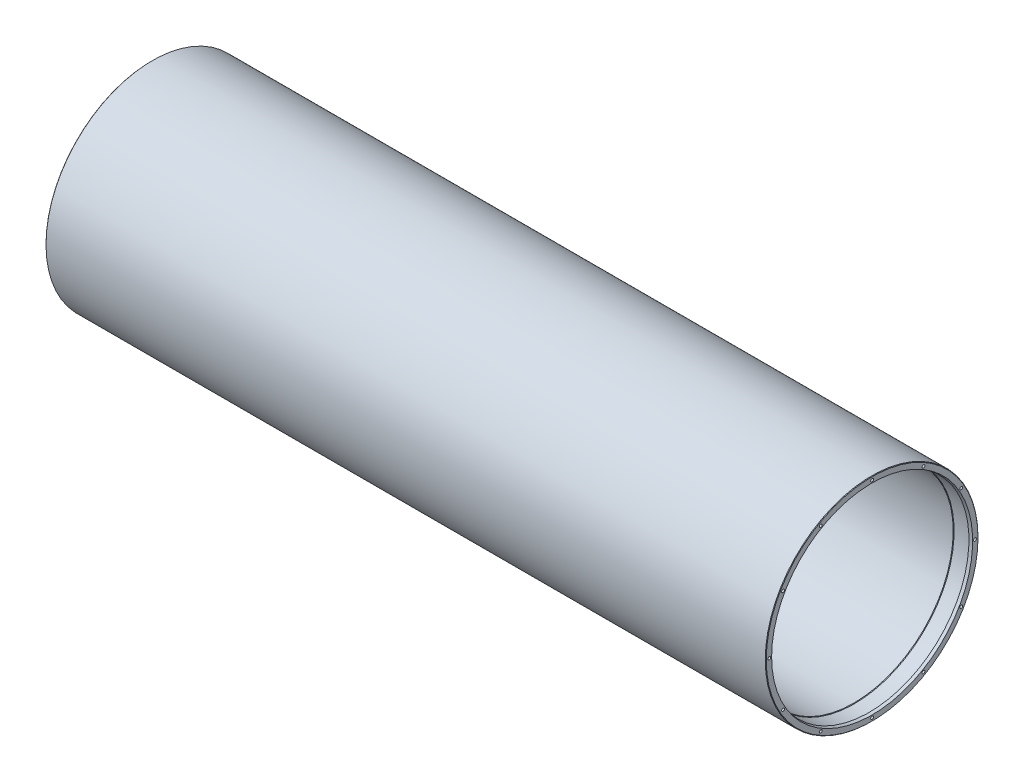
ISO-10303-21;
HEADER;
FILE_DESCRIPTION(('STEP AP214'),'2;1');
FILE_NAME('part.step','',(''),(''),'','','');
FILE_SCHEMA(('AUTOMOTIVE_DESIGN { 1 0 10303 214 1 1 1 1 }'));
ENDSEC;
DATA;
#1=APPLICATION_CONTEXT('core data for automotive mechanical design processes');
#2=APPLICATION_PROTOCOL_DEFINITION('international standard','automotive_design',2000,#1);
#3=PRODUCT_CONTEXT('',#1,'mechanical');
#4=PRODUCT('Part','Part','',(#3));
#5=PRODUCT_RELATED_PRODUCT_CATEGORY('part','',(#4));
#6=PRODUCT_DEFINITION_FORMATION('','',#4);
#7=PRODUCT_DEFINITION_CONTEXT('part definition',#1,'design');
#8=PRODUCT_DEFINITION('design','',#6,#7);
#9=PRODUCT_DEFINITION_SHAPE('','',#8);
#10=(LENGTH_UNIT() NAMED_UNIT(*) SI_UNIT(.MILLI.,.METRE.));
#11=(NAMED_UNIT(*) PLANE_ANGLE_UNIT() SI_UNIT($,.RADIAN.));
#12=(NAMED_UNIT(*) SI_UNIT($,.STERADIAN.) SOLID_ANGLE_UNIT());
#13=UNCERTAINTY_MEASURE_WITH_UNIT(LENGTH_MEASURE(1.E-05),#10,'distance_accuracy_value','');
#14=(GEOMETRIC_REPRESENTATION_CONTEXT(3) GLOBAL_UNCERTAINTY_ASSIGNED_CONTEXT((#13)) GLOBAL_UNIT_ASSIGNED_CONTEXT((#10,
#11,#12)) REPRESENTATION_CONTEXT('',''));
#15=CARTESIAN_POINT('',(0.,0.,0.));
#16=DIRECTION('',(0.,0.,1.));
#17=DIRECTION('',(1.,0.,0.));
#18=AXIS2_PLACEMENT_3D('',#15,#16,#17);
#19=CARTESIAN_POINT('',(6.63558633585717,0.,0.));
#20=DIRECTION('',(-1.,0.,0.));
#21=DIRECTION('',(0.,0.,1.));
#22=AXIS2_PLACEMENT_3D('',#19,#20,#21);
#23=CONICAL_SURFACE('',#22,228.6,0.261799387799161);
#24=CARTESIAN_POINT('',(0.,0.,0.));
#25=DIRECTION('',(-1.,0.,0.));
#26=DIRECTION('',(0.,0.,1.));
#27=AXIS2_PLACEMENT_3D('',#24,#25,#26);
#28=CIRCLE('',#27,230.378);
#29=CARTESIAN_POINT('',(0.,0.,230.378));
#30=VERTEX_POINT('',#29);
#31=EDGE_CURVE('E614',#30,#30,#28,.T.);
#32=ORIENTED_EDGE('',*,*,#31,.T.);
#33=EDGE_LOOP('',(#32));
#34=FACE_BOUND('',#33,.T.);
#35=CARTESIAN_POINT('',(6.63558633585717,0.,0.));
#36=DIRECTION('',(-1.,0.,0.));
#37=DIRECTION('',(0.,0.,1.));
#38=AXIS2_PLACEMENT_3D('',#35,#36,#37);
#39=CIRCLE('',#38,228.6);
#40=CARTESIAN_POINT('',(6.63558633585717,0.,228.6));
#41=VERTEX_POINT('',#40);
#42=EDGE_CURVE('E653',#41,#41,#39,.T.);
#43=ORIENTED_EDGE('',*,*,#42,.F.);
#44=EDGE_LOOP('',(#43));
#45=FACE_BOUND('',#44,.T.);
#46=ADVANCED_FACE('F381',(#34,#45),#23,.F.);
#47=CARTESIAN_POINT('',(0.,0.,0.));
#48=DIRECTION('',(-1.,0.,0.));
#49=DIRECTION('',(0.,0.,1.));
#50=AXIS2_PLACEMENT_3D('',#47,#48,#49);
#51=CYLINDRICAL_SURFACE('',#50,228.6);
#52=ORIENTED_EDGE('',*,*,#42,.T.);
#53=EDGE_LOOP('',(#52));
#54=FACE_BOUND('',#53,.T.);
#55=CARTESIAN_POINT('',(40.64,0.,0.));
#56=DIRECTION('',(-1.,0.,0.));
#57=DIRECTION('',(0.,0.,1.));
#58=AXIS2_PLACEMENT_3D('',#55,#56,#57);
#59=CIRCLE('',#58,228.6);
#60=CARTESIAN_POINT('',(40.64,0.,228.6));
#61=VERTEX_POINT('',#60);
#62=EDGE_CURVE('E650',#61,#61,#59,.T.);
#63=ORIENTED_EDGE('',*,*,#62,.F.);
#64=EDGE_LOOP('',(#63));
#65=FACE_BOUND('',#64,.T.);
#66=ADVANCED_FACE('F760',(#54,#65),#51,.F.);
#67=CARTESIAN_POINT('',(41.9598227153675,0.,0.));
#68=DIRECTION('',(-1.,0.,0.));
#69=DIRECTION('',(0.,0.,1.));
#70=AXIS2_PLACEMENT_3D('',#67,#68,#69);
#71=CONICAL_SURFACE('',#70,227.838,0.523598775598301);
#72=ORIENTED_EDGE('',*,*,#62,.T.);
#73=EDGE_LOOP('',(#72));
#74=FACE_BOUND('',#73,.T.);
#75=CARTESIAN_POINT('',(41.9598227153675,0.,0.));
#76=DIRECTION('',(-1.,0.,0.));
#77=DIRECTION('',(0.,0.,1.));
#78=AXIS2_PLACEMENT_3D('',#75,#76,#77);
#79=CIRCLE('',#78,227.838);
#80=CARTESIAN_POINT('',(41.9598227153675,0.,227.838));
#81=VERTEX_POINT('',#80);
#82=EDGE_CURVE('E647',#81,#81,#79,.T.);
#83=ORIENTED_EDGE('',*,*,#82,.F.);
#84=EDGE_LOOP('',(#83));
#85=FACE_BOUND('',#84,.T.);
#86=ADVANCED_FACE('F765',(#74,#85),#71,.F.);
#87=CARTESIAN_POINT('',(0.,0.,0.));
#88=DIRECTION('',(-1.,0.,0.));
#89=DIRECTION('',(0.,0.,1.));
#90=AXIS2_PLACEMENT_3D('',#87,#88,#89);
#91=CYLINDRICAL_SURFACE('',#90,227.838);
#92=ORIENTED_EDGE('',*,*,#82,.T.);
#93=EDGE_LOOP('',(#92));
#94=FACE_BOUND('',#93,.T.);
#95=CARTESIAN_POINT('',(704.2658,0.,0.));
#96=DIRECTION('',(-1.,0.,0.));
#97=DIRECTION('',(0.,0.,1.));
#98=AXIS2_PLACEMENT_3D('',#95,#96,#97);
#99=CIRCLE('',#98,227.838);
#100=CARTESIAN_POINT('',(704.2658,0.,227.838));
#101=VERTEX_POINT('',#100);
#102=EDGE_CURVE('E644',#101,#101,#99,.T.);
#103=ORIENTED_EDGE('',*,*,#102,.F.);
#104=EDGE_LOOP('',(#103));
#105=FACE_BOUND('',#104,.T.);
#106=ADVANCED_FACE('F775',(#94,#105),#91,.F.);
#107=CARTESIAN_POINT('',(704.2658,0.,0.));
#108=DIRECTION('',(-1.,0.,0.));
#109=DIRECTION('',(0.,0.,1.));
#110=AXIS2_PLACEMENT_3D('',#107,#108,#109);
#111=TOROIDAL_SURFACE('',#110,226.2378,1.60020000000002);
#112=ORIENTED_EDGE('',*,*,#102,.T.);
#113=EDGE_LOOP('',(#112));
#114=FACE_BOUND('',#113,.T.);
#115=CARTESIAN_POINT('',(705.866,0.,0.));
#116=DIRECTION('',(-1.,0.,0.));
#117=DIRECTION('',(0.,0.,1.));
#118=AXIS2_PLACEMENT_3D('',#115,#116,#117);
#119=CIRCLE('',#118,226.2378);
#120=CARTESIAN_POINT('',(705.866,0.,226.2378));
#121=VERTEX_POINT('',#120);
#122=EDGE_CURVE('E641',#121,#121,#119,.T.);
#123=ORIENTED_EDGE('',*,*,#122,.F.);
#124=EDGE_LOOP('',(#123));
#125=FACE_BOUND('',#124,.T.);
#126=ADVANCED_FACE('F781',(#114,#125),#111,.F.);
#127=CARTESIAN_POINT('',(705.866,-222.25,0.));
#128=DIRECTION('',(-1.,0.,0.));
#129=DIRECTION('',(0.,0.,1.));
#130=AXIS2_PLACEMENT_3D('',#127,#128,#129);
#131=PLANE('',#130);
#132=CARTESIAN_POINT('',(705.866,0.,0.));
#133=DIRECTION('',(-1.,0.,0.));
#134=DIRECTION('',(0.,0.,1.));
#135=AXIS2_PLACEMENT_3D('',#132,#133,#134);
#136=CIRCLE('',#135,222.758);
#137=CARTESIAN_POINT('',(705.866,0.,222.758));
#138=VERTEX_POINT('',#137);
#139=EDGE_CURVE('E388',#138,#138,#136,.F.);
#140=ORIENTED_EDGE('',*,*,#139,.T.);
#141=EDGE_LOOP('',(#140));
#142=FACE_BOUND('',#141,.T.);
#143=ORIENTED_EDGE('',*,*,#122,.T.);
#144=EDGE_LOOP('',(#143));
#145=FACE_BOUND('',#144,.T.);
#146=ADVANCED_FACE('F676',(#142,#145),#131,.T.);
#147=CARTESIAN_POINT('',(0.,0.,0.));
#148=DIRECTION('',(-1.,0.,0.));
#149=DIRECTION('',(0.,0.,1.));
#150=AXIS2_PLACEMENT_3D('',#147,#148,#149);
#151=CYLINDRICAL_SURFACE('',#150,222.25);
#152=CARTESIAN_POINT('',(706.307597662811,0.,0.));
#153=DIRECTION('',(-1.,0.,0.));
#154=DIRECTION('',(0.,0.,1.));
#155=AXIS2_PLACEMENT_3D('',#152,#153,#154);
#156=CIRCLE('',#155,222.25);
#157=CARTESIAN_POINT('',(706.307597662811,0.,222.25));
#158=VERTEX_POINT('',#157);
#159=EDGE_CURVE('E671',#158,#158,#156,.T.);
#160=ORIENTED_EDGE('',*,*,#159,.T.);
#161=EDGE_LOOP('',(#160));
#162=FACE_BOUND('',#161,.T.);
#163=CARTESIAN_POINT('',(712.978,0.,0.));
#164=DIRECTION('',(1.,0.,0.));
#165=DIRECTION('',(0.,0.,-1.));
#166=AXIS2_PLACEMENT_3D('',#163,#164,#165);
#167=CIRCLE('',#166,222.25);
#168=CARTESIAN_POINT('',(712.978,0.,-222.25));
#169=VERTEX_POINT('',#168);
#170=EDGE_CURVE('E668',#169,#169,#167,.T.);
#171=ORIENTED_EDGE('',*,*,#170,.T.);
#172=EDGE_LOOP('',(#171));
#173=FACE_BOUND('',#172,.T.);
#174=ADVANCED_FACE('F687',(#162,#173),#151,.F.);
#175=CARTESIAN_POINT('',(713.486,-222.25,0.));
#176=DIRECTION('',(1.,0.,0.));
#177=DIRECTION('',(0.,0.,-1.));
#178=AXIS2_PLACEMENT_3D('',#175,#176,#177);
#179=PLANE('',#178);
#180=CARTESIAN_POINT('',(713.486,0.,0.));
#181=DIRECTION('',(1.,0.,0.));
#182=DIRECTION('',(0.,0.,-1.));
#183=AXIS2_PLACEMENT_3D('',#180,#181,#182);
#184=CIRCLE('',#183,222.691597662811);
#185=CARTESIAN_POINT('',(713.486,0.,-222.691597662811));
#186=VERTEX_POINT('',#185);
#187=EDGE_CURVE('E11',#186,#186,#184,.F.);
#188=ORIENTED_EDGE('',*,*,#187,.T.);
#189=EDGE_LOOP('',(#188));
#190=FACE_BOUND('',#189,.T.);
#191=CARTESIAN_POINT('',(713.486,0.,0.));
#192=DIRECTION('',(-1.,0.,0.));
#193=DIRECTION('',(0.,0.,1.));
#194=AXIS2_PLACEMENT_3D('',#191,#192,#193);
#195=CIRCLE('',#194,224.5868);
#196=CARTESIAN_POINT('',(713.486,0.,224.5868));
#197=VERTEX_POINT('',#196);
#198=EDGE_CURVE('E638',#197,#197,#195,.T.);
#199=ORIENTED_EDGE('',*,*,#198,.F.);
#200=EDGE_LOOP('',(#199));
#201=FACE_BOUND('',#200,.T.);
#202=ADVANCED_FACE('F690',(#190,#201),#179,.T.);
#203=CARTESIAN_POINT('',(714.3242,0.,0.));
#204=DIRECTION('',(-1.,0.,0.));
#205=DIRECTION('',(0.,0.,1.));
#206=AXIS2_PLACEMENT_3D('',#203,#204,#205);
#207=TOROIDAL_SURFACE('',#206,224.5868,0.838200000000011);
#208=ORIENTED_EDGE('',*,*,#198,.T.);
#209=EDGE_LOOP('',(#208));
#210=FACE_BOUND('',#209,.T.);
#211=CARTESIAN_POINT('',(714.3242,0.,0.));
#212=DIRECTION('',(-1.,0.,0.));
#213=DIRECTION('',(0.,0.,1.));
#214=AXIS2_PLACEMENT_3D('',#211,#212,#213);
#215=CIRCLE('',#214,225.425);
#216=CARTESIAN_POINT('',(714.3242,0.,225.425));
#217=VERTEX_POINT('',#216);
#218=EDGE_CURVE('E635',#217,#217,#215,.T.);
#219=ORIENTED_EDGE('',*,*,#218,.F.);
#220=EDGE_LOOP('',(#219));
#221=FACE_BOUND('',#220,.T.);
#222=ADVANCED_FACE('F701',(#210,#221),#207,.F.);
#223=CARTESIAN_POINT('',(0.,0.,0.));
#224=DIRECTION('',(-1.,0.,0.));
#225=DIRECTION('',(0.,0.,1.));
#226=AXIS2_PLACEMENT_3D('',#223,#224,#225);
#227=CYLINDRICAL_SURFACE('',#226,225.425);
#228=ORIENTED_EDGE('',*,*,#218,.T.);
#229=EDGE_LOOP('',(#228));
#230=FACE_BOUND('',#229,.T.);
#231=CARTESIAN_POINT('',(762.646561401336,0.,0.));
#232=DIRECTION('',(-1.,0.,0.));
#233=DIRECTION('',(0.,0.,1.));
#234=AXIS2_PLACEMENT_3D('',#231,#232,#233);
#235=CIRCLE('',#234,225.425);
#236=CARTESIAN_POINT('',(762.646561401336,0.,225.425));
#237=VERTEX_POINT('',#236);
#238=EDGE_CURVE('E632',#237,#237,#235,.T.);
#239=ORIENTED_EDGE('',*,*,#238,.F.);
#240=EDGE_LOOP('',(#239));
#241=FACE_BOUND('',#240,.T.);
#242=ADVANCED_FACE('F707',(#230,#241),#227,.F.);
#243=CARTESIAN_POINT('',(771.652,0.,0.));
#244=DIRECTION('',(1.,0.,0.));
#245=DIRECTION('',(0.,0.,-1.));
#246=AXIS2_PLACEMENT_3D('',#243,#244,#245);
#247=CONICAL_SURFACE('',#246,227.838,0.261799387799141);
#248=ORIENTED_EDGE('',*,*,#238,.T.);
#249=EDGE_LOOP('',(#248));
#250=FACE_BOUND('',#249,.T.);
#251=CARTESIAN_POINT('',(771.652,0.,0.));
#252=DIRECTION('',(-1.,0.,0.));
#253=DIRECTION('',(0.,0.,1.));
#254=AXIS2_PLACEMENT_3D('',#251,#252,#253);
#255=CIRCLE('',#254,227.838);
#256=CARTESIAN_POINT('',(771.652,0.,227.838));
#257=VERTEX_POINT('',#256);
#258=EDGE_CURVE('E629',#257,#257,#255,.T.);
#259=ORIENTED_EDGE('',*,*,#258,.F.);
#260=EDGE_LOOP('',(#259));
#261=FACE_BOUND('',#260,.T.);
#262=ADVANCED_FACE('F713',(#250,#261),#247,.F.);
#263=CARTESIAN_POINT('',(0.,0.,0.));
#264=DIRECTION('',(-1.,0.,0.));
#265=DIRECTION('',(0.,0.,1.));
#266=AXIS2_PLACEMENT_3D('',#263,#264,#265);
#267=CYLINDRICAL_SURFACE('',#266,227.838);
#268=ORIENTED_EDGE('',*,*,#258,.T.);
#269=EDGE_LOOP('',(#268));
#270=FACE_BOUND('',#269,.T.);
#271=CARTESIAN_POINT('',(1609.04017728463,0.,0.));
#272=DIRECTION('',(-1.,0.,0.));
#273=DIRECTION('',(0.,0.,1.));
#274=AXIS2_PLACEMENT_3D('',#271,#272,#273);
#275=CIRCLE('',#274,227.838);
#276=CARTESIAN_POINT('',(1609.04017728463,0.,227.838));
#277=VERTEX_POINT('',#276);
#278=EDGE_CURVE('E626',#277,#277,#275,.T.);
#279=ORIENTED_EDGE('',*,*,#278,.F.);
#280=EDGE_LOOP('',(#279));
#281=FACE_BOUND('',#280,.T.);
#282=ADVANCED_FACE('F719',(#270,#281),#267,.F.);
#283=CARTESIAN_POINT('',(1610.36,0.,0.));
#284=DIRECTION('',(1.,0.,0.));
#285=DIRECTION('',(0.,0.,-1.));
#286=AXIS2_PLACEMENT_3D('',#283,#284,#285);
#287=CONICAL_SURFACE('',#286,228.6,0.523598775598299);
#288=ORIENTED_EDGE('',*,*,#278,.T.);
#289=EDGE_LOOP('',(#288));
#290=FACE_BOUND('',#289,.T.);
#291=CARTESIAN_POINT('',(1610.36,0.,0.));
#292=DIRECTION('',(-1.,0.,0.));
#293=DIRECTION('',(0.,0.,1.));
#294=AXIS2_PLACEMENT_3D('',#291,#292,#293);
#295=CIRCLE('',#294,228.6);
#296=CARTESIAN_POINT('',(1610.36,0.,228.6));
#297=VERTEX_POINT('',#296);
#298=EDGE_CURVE('E623',#297,#297,#295,.T.);
#299=ORIENTED_EDGE('',*,*,#298,.F.);
#300=EDGE_LOOP('',(#299));
#301=FACE_BOUND('',#300,.T.);
#302=ADVANCED_FACE('F725',(#290,#301),#287,.F.);
#303=CARTESIAN_POINT('',(0.,0.,0.));
#304=DIRECTION('',(-1.,0.,0.));
#305=DIRECTION('',(0.,0.,1.));
#306=AXIS2_PLACEMENT_3D('',#303,#304,#305);
#307=CYLINDRICAL_SURFACE('',#306,228.6);
#308=ORIENTED_EDGE('',*,*,#298,.T.);
#309=EDGE_LOOP('',(#308));
#310=FACE_BOUND('',#309,.T.);
#311=CARTESIAN_POINT('',(1644.36441366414,0.,0.));
#312=DIRECTION('',(-1.,0.,0.));
#313=DIRECTION('',(0.,0.,1.));
#314=AXIS2_PLACEMENT_3D('',#311,#312,#313);
#315=CIRCLE('',#314,228.6);
#316=CARTESIAN_POINT('',(1644.36441366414,0.,228.6));
#317=VERTEX_POINT('',#316);
#318=EDGE_CURVE('E620',#317,#317,#315,.T.);
#319=ORIENTED_EDGE('',*,*,#318,.F.);
#320=EDGE_LOOP('',(#319));
#321=FACE_BOUND('',#320,.T.);
#322=ADVANCED_FACE('F731',(#310,#321),#307,.F.);
#323=CARTESIAN_POINT('',(1651.,0.,0.));
#324=DIRECTION('',(1.,0.,0.));
#325=DIRECTION('',(0.,0.,-1.));
#326=AXIS2_PLACEMENT_3D('',#323,#324,#325);
#327=CONICAL_SURFACE('',#326,230.378,0.261799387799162);
#328=ORIENTED_EDGE('',*,*,#318,.T.);
#329=EDGE_LOOP('',(#328));
#330=FACE_BOUND('',#329,.T.);
#331=CARTESIAN_POINT('',(1651.,0.,0.));
#332=DIRECTION('',(-1.,0.,0.));
#333=DIRECTION('',(0.,0.,1.));
#334=AXIS2_PLACEMENT_3D('',#331,#332,#333);
#335=CIRCLE('',#334,230.378);
#336=CARTESIAN_POINT('',(1651.,0.,230.378));
#337=VERTEX_POINT('',#336);
#338=EDGE_CURVE('E617',#337,#337,#335,.T.);
#339=ORIENTED_EDGE('',*,*,#338,.F.);
#340=EDGE_LOOP('',(#339));
#341=FACE_BOUND('',#340,.T.);
#342=ADVANCED_FACE('F737',(#330,#341),#327,.F.);
#343=CARTESIAN_POINT('',(1651.,-230.378,0.));
#344=DIRECTION('',(1.,0.,0.));
#345=DIRECTION('',(0.,0.,-1.));
#346=AXIS2_PLACEMENT_3D('',#343,#344,#345);
#347=PLANE('',#346);
#348=CARTESIAN_POINT('',(1651.,0.,0.));
#349=DIRECTION('',(1.,0.,0.));
#350=DIRECTION('',(0.,0.,-1.));
#351=AXIS2_PLACEMENT_3D('',#348,#349,#350);
#352=CIRCLE('',#351,242.697);
#353=CARTESIAN_POINT('',(1651.,0.,-242.697));
#354=VERTEX_POINT('',#353);
#355=EDGE_CURVE('E665',#354,#354,#352,.T.);
#356=ORIENTED_EDGE('',*,*,#355,.T.);
#357=EDGE_LOOP('',(#356));
#358=FACE_BOUND('',#357,.T.);
#359=CARTESIAN_POINT('',(1651.,204.132579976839,-117.855999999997));
#360=DIRECTION('',(1.,0.,0.));
#361=DIRECTION('',(0.,0.,-1.));
#362=AXIS2_PLACEMENT_3D('',#359,#360,#361);
#363=CIRCLE('',#362,3.26389999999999);
#364=CARTESIAN_POINT('',(1651.,204.132579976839,-121.119899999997));
#365=VERTEX_POINT('',#364);
#366=EDGE_CURVE('E471',#365,#365,#363,.T.);
#367=ORIENTED_EDGE('',*,*,#366,.F.);
#368=EDGE_LOOP('',(#367));
#369=FACE_BOUND('',#368,.T.);
#370=CARTESIAN_POINT('',(1651.,117.856000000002,-204.132579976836));
#371=DIRECTION('',(1.,0.,0.));
#372=DIRECTION('',(0.,0.,-1.));
#373=AXIS2_PLACEMENT_3D('',#370,#371,#372);
#374=CIRCLE('',#373,3.2639);
#375=CARTESIAN_POINT('',(1651.,117.856000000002,-207.396479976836));
#376=VERTEX_POINT('',#375);
#377=EDGE_CURVE('E479',#376,#376,#374,.T.);
#378=ORIENTED_EDGE('',*,*,#377,.F.);
#379=EDGE_LOOP('',(#378));
#380=FACE_BOUND('',#379,.T.);
#381=CARTESIAN_POINT('',(1651.,2.46895357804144E-12,-235.712));
#382=DIRECTION('',(1.,0.,0.));
#383=DIRECTION('',(0.,0.,-1.));
#384=AXIS2_PLACEMENT_3D('',#381,#382,#383);
#385=CIRCLE('',#384,3.2639);
#386=CARTESIAN_POINT('',(1651.,2.46895357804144E-12,-238.9759));
#387=VERTEX_POINT('',#386);
#388=EDGE_CURVE('E485',#387,#387,#385,.T.);
#389=ORIENTED_EDGE('',*,*,#388,.F.);
#390=EDGE_LOOP('',(#389));
#391=FACE_BOUND('',#390,.T.);
#392=CARTESIAN_POINT('',(1651.,-117.855999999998,-204.132579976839));
#393=DIRECTION('',(1.,0.,0.));
#394=DIRECTION('',(0.,0.,-1.));
#395=AXIS2_PLACEMENT_3D('',#392,#393,#394);
#396=CIRCLE('',#395,3.2639);
#397=CARTESIAN_POINT('',(1651.,-117.855999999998,-207.396479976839));
#398=VERTEX_POINT('',#397);
#399=EDGE_CURVE('E491',#398,#398,#396,.T.);
#400=ORIENTED_EDGE('',*,*,#399,.F.);
#401=EDGE_LOOP('',(#400));
#402=FACE_BOUND('',#401,.T.);
#403=CARTESIAN_POINT('',(1651.,-204.132579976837,-117.856000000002));
#404=DIRECTION('',(1.,0.,0.));
#405=DIRECTION('',(0.,0.,-1.));
#406=AXIS2_PLACEMENT_3D('',#403,#404,#405);
#407=CIRCLE('',#406,3.26389999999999);
#408=CARTESIAN_POINT('',(1651.,-204.132579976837,-121.119900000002));
#409=VERTEX_POINT('',#408);
#410=EDGE_CURVE('E497',#409,#409,#407,.T.);
#411=ORIENTED_EDGE('',*,*,#410,.F.);
#412=EDGE_LOOP('',(#411));
#413=FACE_BOUND('',#412,.T.);
#414=CARTESIAN_POINT('',(1651.,-235.712,-1.64596905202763E-12));
#415=DIRECTION('',(1.,0.,0.));
#416=DIRECTION('',(0.,0.,-1.));
#417=AXIS2_PLACEMENT_3D('',#414,#415,#416);
#418=CIRCLE('',#417,3.26389999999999);
#419=CARTESIAN_POINT('',(1651.,-235.712,-3.26390000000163));
#420=VERTEX_POINT('',#419);
#421=EDGE_CURVE('E503',#420,#420,#418,.T.);
#422=ORIENTED_EDGE('',*,*,#421,.F.);
#423=EDGE_LOOP('',(#422));
#424=FACE_BOUND('',#423,.T.);
#425=CARTESIAN_POINT('',(1651.,-204.132579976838,117.855999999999));
#426=DIRECTION('',(1.,0.,0.));
#427=DIRECTION('',(0.,0.,-1.));
#428=AXIS2_PLACEMENT_3D('',#425,#426,#427);
#429=CIRCLE('',#428,3.26389999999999);
#430=CARTESIAN_POINT('',(1651.,-204.132579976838,114.592099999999));
#431=VERTEX_POINT('',#430);
#432=EDGE_CURVE('E509',#431,#431,#429,.T.);
#433=ORIENTED_EDGE('',*,*,#432,.F.);
#434=EDGE_LOOP('',(#433));
#435=FACE_BOUND('',#434,.T.);
#436=CARTESIAN_POINT('',(1651.,-117.856000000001,204.132579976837));
#437=DIRECTION('',(1.,0.,0.));
#438=DIRECTION('',(0.,0.,-1.));
#439=AXIS2_PLACEMENT_3D('',#436,#437,#438);
#440=CIRCLE('',#439,3.2639);
#441=CARTESIAN_POINT('',(1651.,-117.856000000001,200.868679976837));
#442=VERTEX_POINT('',#441);
#443=EDGE_CURVE('E515',#442,#442,#440,.T.);
#444=ORIENTED_EDGE('',*,*,#443,.F.);
#445=EDGE_LOOP('',(#444));
#446=FACE_BOUND('',#445,.T.);
#447=CARTESIAN_POINT('',(1651.,-8.22984526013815E-13,235.712));
#448=DIRECTION('',(1.,0.,0.));
#449=DIRECTION('',(0.,0.,-1.));
#450=AXIS2_PLACEMENT_3D('',#447,#448,#449);
#451=CIRCLE('',#450,3.2639);
#452=CARTESIAN_POINT('',(1651.,-8.22984526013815E-13,232.4481));
#453=VERTEX_POINT('',#452);
#454=EDGE_CURVE('E521',#453,#453,#451,.T.);
#455=ORIENTED_EDGE('',*,*,#454,.F.);
#456=EDGE_LOOP('',(#455));
#457=FACE_BOUND('',#456,.T.);
#458=CARTESIAN_POINT('',(1651.,117.856,204.132579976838));
#459=DIRECTION('',(1.,0.,0.));
#460=DIRECTION('',(0.,0.,-1.));
#461=AXIS2_PLACEMENT_3D('',#458,#459,#460);
#462=CIRCLE('',#461,3.2639);
#463=CARTESIAN_POINT('',(1651.,117.856,200.868679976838));
#464=VERTEX_POINT('',#463);
#465=EDGE_CURVE('E527',#464,#464,#462,.T.);
#466=ORIENTED_EDGE('',*,*,#465,.F.);
#467=EDGE_LOOP('',(#466));
#468=FACE_BOUND('',#467,.T.);
#469=CARTESIAN_POINT('',(1651.,204.132579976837,117.856));
#470=DIRECTION('',(1.,0.,0.));
#471=DIRECTION('',(0.,0.,-1.));
#472=AXIS2_PLACEMENT_3D('',#469,#470,#471);
#473=CIRCLE('',#472,3.26389999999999);
#474=CARTESIAN_POINT('',(1651.,204.132579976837,114.5921));
#475=VERTEX_POINT('',#474);
#476=EDGE_CURVE('E533',#475,#475,#473,.T.);
#477=ORIENTED_EDGE('',*,*,#476,.F.);
#478=EDGE_LOOP('',(#477));
#479=FACE_BOUND('',#478,.T.);
#480=CARTESIAN_POINT('',(1651.,235.712,0.));
#481=DIRECTION('',(1.,0.,0.));
#482=DIRECTION('',(0.,0.,-1.));
#483=AXIS2_PLACEMENT_3D('',#480,#481,#482);
#484=CIRCLE('',#483,3.26389999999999);
#485=CARTESIAN_POINT('',(1651.,235.712,-3.26389999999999));
#486=VERTEX_POINT('',#485);
#487=EDGE_CURVE('E539',#486,#486,#484,.T.);
#488=ORIENTED_EDGE('',*,*,#487,.F.);
#489=EDGE_LOOP('',(#488));
#490=FACE_BOUND('',#489,.T.);
#491=ORIENTED_EDGE('',*,*,#338,.T.);
#492=EDGE_LOOP('',(#491));
#493=FACE_BOUND('',#492,.T.);
#494=ADVANCED_FACE('F743',(#358,#369,#380,#391,#402,#413,#424,#435,#446,#457,#468,#479,#490,
#493),#347,.T.);
#495=CARTESIAN_POINT('',(0.,0.,0.));
#496=DIRECTION('',(-1.,0.,0.));
#497=DIRECTION('',(0.,0.,1.));
#498=AXIS2_PLACEMENT_3D('',#495,#496,#497);
#499=CYLINDRICAL_SURFACE('',#498,243.84);
#500=CARTESIAN_POINT('',(1649.857,0.,0.));
#501=DIRECTION('',(1.,0.,0.));
#502=DIRECTION('',(0.,0.,-1.));
#503=AXIS2_PLACEMENT_3D('',#500,#501,#502);
#504=CIRCLE('',#503,243.84);
#505=CARTESIAN_POINT('',(1649.857,0.,-243.84));
#506=VERTEX_POINT('',#505);
#507=EDGE_CURVE('E662',#506,#506,#504,.F.);
#508=ORIENTED_EDGE('',*,*,#507,.T.);
#509=EDGE_LOOP('',(#508));
#510=FACE_BOUND('',#509,.T.);
#511=CARTESIAN_POINT('',(1.14300000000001,0.,0.));
#512=DIRECTION('',(-1.,0.,0.));
#513=DIRECTION('',(0.,0.,1.));
#514=AXIS2_PLACEMENT_3D('',#511,#512,#513);
#515=CIRCLE('',#514,243.84);
#516=CARTESIAN_POINT('',(1.14300000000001,0.,243.84));
#517=VERTEX_POINT('',#516);
#518=EDGE_CURVE('E659',#517,#517,#515,.F.);
#519=ORIENTED_EDGE('',*,*,#518,.T.);
#520=EDGE_LOOP('',(#519));
#521=FACE_BOUND('',#520,.T.);
#522=ADVANCED_FACE('F748',(#510,#521),#499,.T.);
#523=CARTESIAN_POINT('',(0.,-230.378,0.));
#524=DIRECTION('',(-1.,0.,0.));
#525=DIRECTION('',(0.,0.,1.));
#526=AXIS2_PLACEMENT_3D('',#523,#524,#525);
#527=PLANE('',#526);
#528=CARTESIAN_POINT('',(0.,0.,0.));
#529=DIRECTION('',(-1.,0.,0.));
#530=DIRECTION('',(0.,0.,1.));
#531=AXIS2_PLACEMENT_3D('',#528,#529,#530);
#532=CIRCLE('',#531,242.697);
#533=CARTESIAN_POINT('',(0.,0.,242.697));
#534=VERTEX_POINT('',#533);
#535=EDGE_CURVE('E656',#534,#534,#532,.T.);
#536=ORIENTED_EDGE('',*,*,#535,.T.);
#537=EDGE_LOOP('',(#536));
#538=FACE_BOUND('',#537,.T.);
#539=CARTESIAN_POINT('',(0.,204.132579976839,-117.855999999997));
#540=DIRECTION('',(-1.,0.,0.));
#541=DIRECTION('',(0.,0.,1.));
#542=AXIS2_PLACEMENT_3D('',#539,#540,#541);
#543=CIRCLE('',#542,3.26389999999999);
#544=CARTESIAN_POINT('',(0.,204.132579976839,-114.592099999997));
#545=VERTEX_POINT('',#544);
#546=EDGE_CURVE('E545',#545,#545,#543,.T.);
#547=ORIENTED_EDGE('',*,*,#546,.F.);
#548=EDGE_LOOP('',(#547));
#549=FACE_BOUND('',#548,.T.);
#550=CARTESIAN_POINT('',(0.,117.856000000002,-204.132579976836));
#551=DIRECTION('',(-1.,0.,0.));
#552=DIRECTION('',(0.,0.,1.));
#553=AXIS2_PLACEMENT_3D('',#550,#551,#552);
#554=CIRCLE('',#553,3.2639);
#555=CARTESIAN_POINT('',(0.,117.856000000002,-200.868679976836));
#556=VERTEX_POINT('',#555);
#557=EDGE_CURVE('E551',#556,#556,#554,.T.);
#558=ORIENTED_EDGE('',*,*,#557,.F.);
#559=EDGE_LOOP('',(#558));
#560=FACE_BOUND('',#559,.T.);
#561=CARTESIAN_POINT('',(0.,2.46895357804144E-12,-235.712));
#562=DIRECTION('',(-1.,0.,0.));
#563=DIRECTION('',(0.,0.,1.));
#564=AXIS2_PLACEMENT_3D('',#561,#562,#563);
#565=CIRCLE('',#564,3.2639);
#566=CARTESIAN_POINT('',(0.,2.46895357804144E-12,-232.4481));
#567=VERTEX_POINT('',#566);
#568=EDGE_CURVE('E557',#567,#567,#565,.T.);
#569=ORIENTED_EDGE('',*,*,#568,.F.);
#570=EDGE_LOOP('',(#569));
#571=FACE_BOUND('',#570,.T.);
#572=CARTESIAN_POINT('',(0.,-117.855999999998,-204.132579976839));
#573=DIRECTION('',(-1.,0.,0.));
#574=DIRECTION('',(0.,0.,1.));
#575=AXIS2_PLACEMENT_3D('',#572,#573,#574);
#576=CIRCLE('',#575,3.2639);
#577=CARTESIAN_POINT('',(0.,-117.855999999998,-200.868679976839));
#578=VERTEX_POINT('',#577);
#579=EDGE_CURVE('E563',#578,#578,#576,.T.);
#580=ORIENTED_EDGE('',*,*,#579,.F.);
#581=EDGE_LOOP('',(#580));
#582=FACE_BOUND('',#581,.T.);
#583=CARTESIAN_POINT('',(0.,-204.132579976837,-117.856000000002));
#584=DIRECTION('',(-1.,0.,0.));
#585=DIRECTION('',(0.,0.,1.));
#586=AXIS2_PLACEMENT_3D('',#583,#584,#585);
#587=CIRCLE('',#586,3.26389999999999);
#588=CARTESIAN_POINT('',(0.,-204.132579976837,-114.592100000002));
#589=VERTEX_POINT('',#588);
#590=EDGE_CURVE('E569',#589,#589,#587,.T.);
#591=ORIENTED_EDGE('',*,*,#590,.F.);
#592=EDGE_LOOP('',(#591));
#593=FACE_BOUND('',#592,.T.);
#594=CARTESIAN_POINT('',(0.,-235.712,-1.64596905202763E-12));
#595=DIRECTION('',(-1.,0.,0.));
#596=DIRECTION('',(0.,0.,1.));
#597=AXIS2_PLACEMENT_3D('',#594,#595,#596);
#598=CIRCLE('',#597,3.26389999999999);
#599=CARTESIAN_POINT('',(0.,-235.712,3.26389999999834));
#600=VERTEX_POINT('',#599);
#601=EDGE_CURVE('E575',#600,#600,#598,.T.);
#602=ORIENTED_EDGE('',*,*,#601,.F.);
#603=EDGE_LOOP('',(#602));
#604=FACE_BOUND('',#603,.T.);
#605=CARTESIAN_POINT('',(0.,-204.132579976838,117.855999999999));
#606=DIRECTION('',(-1.,0.,0.));
#607=DIRECTION('',(0.,0.,1.));
#608=AXIS2_PLACEMENT_3D('',#605,#606,#607);
#609=CIRCLE('',#608,3.26389999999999);
#610=CARTESIAN_POINT('',(0.,-204.132579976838,121.119899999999));
#611=VERTEX_POINT('',#610);
#612=EDGE_CURVE('E581',#611,#611,#609,.T.);
#613=ORIENTED_EDGE('',*,*,#612,.F.);
#614=EDGE_LOOP('',(#613));
#615=FACE_BOUND('',#614,.T.);
#616=CARTESIAN_POINT('',(0.,-117.856000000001,204.132579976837));
#617=DIRECTION('',(-1.,0.,0.));
#618=DIRECTION('',(0.,0.,1.));
#619=AXIS2_PLACEMENT_3D('',#616,#617,#618);
#620=CIRCLE('',#619,3.2639);
#621=CARTESIAN_POINT('',(0.,-117.856000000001,207.396479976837));
#622=VERTEX_POINT('',#621);
#623=EDGE_CURVE('E587',#622,#622,#620,.T.);
#624=ORIENTED_EDGE('',*,*,#623,.F.);
#625=EDGE_LOOP('',(#624));
#626=FACE_BOUND('',#625,.T.);
#627=CARTESIAN_POINT('',(0.,-8.22984526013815E-13,235.712));
#628=DIRECTION('',(-1.,0.,0.));
#629=DIRECTION('',(0.,0.,1.));
#630=AXIS2_PLACEMENT_3D('',#627,#628,#629);
#631=CIRCLE('',#630,3.2639);
#632=CARTESIAN_POINT('',(0.,-8.22984526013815E-13,238.9759));
#633=VERTEX_POINT('',#632);
#634=EDGE_CURVE('E593',#633,#633,#631,.T.);
#635=ORIENTED_EDGE('',*,*,#634,.F.);
#636=EDGE_LOOP('',(#635));
#637=FACE_BOUND('',#636,.T.);
#638=CARTESIAN_POINT('',(0.,117.856,204.132579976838));
#639=DIRECTION('',(-1.,0.,0.));
#640=DIRECTION('',(0.,0.,1.));
#641=AXIS2_PLACEMENT_3D('',#638,#639,#640);
#642=CIRCLE('',#641,3.2639);
#643=CARTESIAN_POINT('',(0.,117.856,207.396479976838));
#644=VERTEX_POINT('',#643);
#645=EDGE_CURVE('E599',#644,#644,#642,.T.);
#646=ORIENTED_EDGE('',*,*,#645,.F.);
#647=EDGE_LOOP('',(#646));
#648=FACE_BOUND('',#647,.T.);
#649=CARTESIAN_POINT('',(0.,204.132579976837,117.856));
#650=DIRECTION('',(-1.,0.,0.));
#651=DIRECTION('',(0.,0.,1.));
#652=AXIS2_PLACEMENT_3D('',#649,#650,#651);
#653=CIRCLE('',#652,3.26389999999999);
#654=CARTESIAN_POINT('',(0.,204.132579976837,121.1199));
#655=VERTEX_POINT('',#654);
#656=EDGE_CURVE('E605',#655,#655,#653,.T.);
#657=ORIENTED_EDGE('',*,*,#656,.F.);
#658=EDGE_LOOP('',(#657));
#659=FACE_BOUND('',#658,.T.);
#660=CARTESIAN_POINT('',(0.,235.712,0.));
#661=DIRECTION('',(-1.,0.,0.));
#662=DIRECTION('',(0.,0.,1.));
#663=AXIS2_PLACEMENT_3D('',#660,#661,#662);
#664=CIRCLE('',#663,3.26389999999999);
#665=CARTESIAN_POINT('',(0.,235.712,3.26389999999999));
#666=VERTEX_POINT('',#665);
#667=EDGE_CURVE('E611',#666,#666,#664,.T.);
#668=ORIENTED_EDGE('',*,*,#667,.F.);
#669=EDGE_LOOP('',(#668));
#670=FACE_BOUND('',#669,.T.);
#671=ORIENTED_EDGE('',*,*,#31,.F.);
#672=EDGE_LOOP('',(#671));
#673=FACE_BOUND('',#672,.T.);
#674=ADVANCED_FACE('F755',(#538,#549,#560,#571,#582,#593,#604,#615,#626,#637,#648,#659,#670,
#673),#527,.T.);
#675=CARTESIAN_POINT('',(0.,235.712,0.));
#676=DIRECTION('',(-1.,0.,0.));
#677=DIRECTION('',(0.,0.,1.));
#678=AXIS2_PLACEMENT_3D('',#675,#676,#677);
#679=CYLINDRICAL_SURFACE('',#678,3.26389999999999);
#680=CARTESIAN_POINT('',(31.75,235.712,0.));
#681=DIRECTION('',(-1.,0.,0.));
#682=DIRECTION('',(0.,0.,1.));
#683=AXIS2_PLACEMENT_3D('',#680,#681,#682);
#684=CIRCLE('',#683,3.26389999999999);
#685=CARTESIAN_POINT('',(31.75,235.712,3.26389999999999));
#686=VERTEX_POINT('',#685);
#687=EDGE_CURVE('E608',#686,#686,#684,.T.);
#688=ORIENTED_EDGE('',*,*,#687,.F.);
#689=EDGE_LOOP('',(#688));
#690=FACE_BOUND('',#689,.T.);
#691=ORIENTED_EDGE('',*,*,#667,.T.);
#692=EDGE_LOOP('',(#691));
#693=FACE_BOUND('',#692,.T.);
#694=ADVANCED_FACE('F1195',(#690,#693),#679,.F.);
#695=CARTESIAN_POINT('',(31.75,235.712,0.));
#696=DIRECTION('',(-1.,0.,0.));
#697=DIRECTION('',(0.,0.,1.));
#698=AXIS2_PLACEMENT_3D('',#695,#696,#697);
#699=CONICAL_SURFACE('',#698,3.26389999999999,1.02974425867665);
#700=CARTESIAN_POINT('',(33.7111489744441,235.712,0.));
#701=VERTEX_POINT('',#700);
#702=VERTEX_LOOP('',#701);
#703=FACE_BOUND('',#702,.T.);
#704=ORIENTED_EDGE('',*,*,#687,.T.);
#705=EDGE_LOOP('',(#704));
#706=FACE_BOUND('',#705,.T.);
#707=ADVANCED_FACE('F1187',(#703,#706),#699,.F.);
#708=CARTESIAN_POINT('',(0.,204.132579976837,117.856));
#709=DIRECTION('',(-1.,0.,0.));
#710=DIRECTION('',(0.,0.,1.));
#711=AXIS2_PLACEMENT_3D('',#708,#709,#710);
#712=CYLINDRICAL_SURFACE('',#711,3.26389999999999);
#713=CARTESIAN_POINT('',(31.75,204.132579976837,117.856));
#714=DIRECTION('',(-1.,0.,0.));
#715=DIRECTION('',(0.,0.,1.));
#716=AXIS2_PLACEMENT_3D('',#713,#714,#715);
#717=CIRCLE('',#716,3.26389999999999);
#718=CARTESIAN_POINT('',(31.75,204.132579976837,121.1199));
#719=VERTEX_POINT('',#718);
#720=EDGE_CURVE('E602',#719,#719,#717,.T.);
#721=ORIENTED_EDGE('',*,*,#720,.F.);
#722=EDGE_LOOP('',(#721));
#723=FACE_BOUND('',#722,.T.);
#724=ORIENTED_EDGE('',*,*,#656,.T.);
#725=EDGE_LOOP('',(#724));
#726=FACE_BOUND('',#725,.T.);
#727=ADVANCED_FACE('F1180',(#723,#726),#712,.F.);
#728=CARTESIAN_POINT('',(31.75,204.132579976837,117.856));
#729=DIRECTION('',(-1.,0.,0.));
#730=DIRECTION('',(0.,0.,1.));
#731=AXIS2_PLACEMENT_3D('',#728,#729,#730);
#732=CONICAL_SURFACE('',#731,3.26389999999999,1.02974425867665);
#733=CARTESIAN_POINT('',(33.7111489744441,204.132579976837,117.856));
#734=VERTEX_POINT('',#733);
#735=VERTEX_LOOP('',#734);
#736=FACE_BOUND('',#735,.T.);
#737=ORIENTED_EDGE('',*,*,#720,.T.);
#738=EDGE_LOOP('',(#737));
#739=FACE_BOUND('',#738,.T.);
#740=ADVANCED_FACE('F1172',(#736,#739),#732,.F.);
#741=CARTESIAN_POINT('',(0.,117.856,204.132579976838));
#742=DIRECTION('',(-1.,0.,0.));
#743=DIRECTION('',(0.,0.,1.));
#744=AXIS2_PLACEMENT_3D('',#741,#742,#743);
#745=CYLINDRICAL_SURFACE('',#744,3.2639);
#746=CARTESIAN_POINT('',(31.75,117.856,204.132579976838));
#747=DIRECTION('',(-1.,0.,0.));
#748=DIRECTION('',(0.,0.,1.));
#749=AXIS2_PLACEMENT_3D('',#746,#747,#748);
#750=CIRCLE('',#749,3.2639);
#751=CARTESIAN_POINT('',(31.75,117.856,207.396479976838));
#752=VERTEX_POINT('',#751);
#753=EDGE_CURVE('E596',#752,#752,#750,.T.);
#754=ORIENTED_EDGE('',*,*,#753,.F.);
#755=EDGE_LOOP('',(#754));
#756=FACE_BOUND('',#755,.T.);
#757=ORIENTED_EDGE('',*,*,#645,.T.);
#758=EDGE_LOOP('',(#757));
#759=FACE_BOUND('',#758,.T.);
#760=ADVANCED_FACE('F1164',(#756,#759),#745,.F.);
#761=CARTESIAN_POINT('',(31.75,117.856,204.132579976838));
#762=DIRECTION('',(-1.,0.,0.));
#763=DIRECTION('',(0.,0.,1.));
#764=AXIS2_PLACEMENT_3D('',#761,#762,#763);
#765=CONICAL_SURFACE('',#764,3.2639,1.02974425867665);
#766=CARTESIAN_POINT('',(33.7111489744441,117.855999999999,204.132579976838));
#767=VERTEX_POINT('',#766);
#768=VERTEX_LOOP('',#767);
#769=FACE_BOUND('',#768,.T.);
#770=ORIENTED_EDGE('',*,*,#753,.T.);
#771=EDGE_LOOP('',(#770));
#772=FACE_BOUND('',#771,.T.);
#773=ADVANCED_FACE('F1156',(#769,#772),#765,.F.);
#774=CARTESIAN_POINT('',(0.,-8.22984526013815E-13,235.712));
#775=DIRECTION('',(-1.,0.,0.));
#776=DIRECTION('',(0.,0.,1.));
#777=AXIS2_PLACEMENT_3D('',#774,#775,#776);
#778=CYLINDRICAL_SURFACE('',#777,3.2639);
#779=CARTESIAN_POINT('',(31.75,-8.22984526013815E-13,235.712));
#780=DIRECTION('',(-1.,0.,0.));
#781=DIRECTION('',(0.,0.,1.));
#782=AXIS2_PLACEMENT_3D('',#779,#780,#781);
#783=CIRCLE('',#782,3.26389999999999);
#784=CARTESIAN_POINT('',(31.75,-8.22984526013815E-13,238.9759));
#785=VERTEX_POINT('',#784);
#786=EDGE_CURVE('E590',#785,#785,#783,.T.);
#787=ORIENTED_EDGE('',*,*,#786,.F.);
#788=EDGE_LOOP('',(#787));
#789=FACE_BOUND('',#788,.T.);
#790=ORIENTED_EDGE('',*,*,#634,.T.);
#791=EDGE_LOOP('',(#790));
#792=FACE_BOUND('',#791,.T.);
#793=ADVANCED_FACE('F1148',(#789,#792),#778,.F.);
#794=CARTESIAN_POINT('',(31.75,-8.22984526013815E-13,235.712));
#795=DIRECTION('',(-1.,0.,0.));
#796=DIRECTION('',(0.,0.,1.));
#797=AXIS2_PLACEMENT_3D('',#794,#795,#796);
#798=CONICAL_SURFACE('',#797,3.26389999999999,1.02974425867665);
#799=CARTESIAN_POINT('',(33.7111489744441,-8.31241103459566E-13,235.712));
#800=VERTEX_POINT('',#799);
#801=VERTEX_LOOP('',#800);
#802=FACE_BOUND('',#801,.T.);
#803=ORIENTED_EDGE('',*,*,#786,.T.);
#804=EDGE_LOOP('',(#803));
#805=FACE_BOUND('',#804,.T.);
#806=ADVANCED_FACE('F1140',(#802,#805),#798,.F.);
#807=CARTESIAN_POINT('',(0.,-117.856000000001,204.132579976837));
#808=DIRECTION('',(-1.,0.,0.));
#809=DIRECTION('',(0.,0.,1.));
#810=AXIS2_PLACEMENT_3D('',#807,#808,#809);
#811=CYLINDRICAL_SURFACE('',#810,3.2639);
#812=CARTESIAN_POINT('',(31.75,-117.856000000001,204.132579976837));
#813=DIRECTION('',(-1.,0.,0.));
#814=DIRECTION('',(0.,0.,1.));
#815=AXIS2_PLACEMENT_3D('',#812,#813,#814);
#816=CIRCLE('',#815,3.2639);
#817=CARTESIAN_POINT('',(31.75,-117.856000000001,207.396479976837));
#818=VERTEX_POINT('',#817);
#819=EDGE_CURVE('E584',#818,#818,#816,.T.);
#820=ORIENTED_EDGE('',*,*,#819,.F.);
#821=EDGE_LOOP('',(#820));
#822=FACE_BOUND('',#821,.T.);
#823=ORIENTED_EDGE('',*,*,#623,.T.);
#824=EDGE_LOOP('',(#823));
#825=FACE_BOUND('',#824,.T.);
#826=ADVANCED_FACE('F1132',(#822,#825),#811,.F.);
#827=CARTESIAN_POINT('',(31.75,-117.856000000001,204.132579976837));
#828=DIRECTION('',(-1.,0.,0.));
#829=DIRECTION('',(0.,0.,1.));
#830=AXIS2_PLACEMENT_3D('',#827,#828,#829);
#831=CONICAL_SURFACE('',#830,3.2639,1.02974425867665);
#832=CARTESIAN_POINT('',(33.7111489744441,-117.856000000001,204.132579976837));
#833=VERTEX_POINT('',#832);
#834=VERTEX_LOOP('',#833);
#835=FACE_BOUND('',#834,.T.);
#836=ORIENTED_EDGE('',*,*,#819,.T.);
#837=EDGE_LOOP('',(#836));
#838=FACE_BOUND('',#837,.T.);
#839=ADVANCED_FACE('F1124',(#835,#838),#831,.F.);
#840=CARTESIAN_POINT('',(0.,-204.132579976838,117.855999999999));
#841=DIRECTION('',(-1.,0.,0.));
#842=DIRECTION('',(0.,0.,1.));
#843=AXIS2_PLACEMENT_3D('',#840,#841,#842);
#844=CYLINDRICAL_SURFACE('',#843,3.26389999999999);
#845=CARTESIAN_POINT('',(31.75,-204.132579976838,117.855999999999));
#846=DIRECTION('',(-1.,0.,0.));
#847=DIRECTION('',(0.,0.,1.));
#848=AXIS2_PLACEMENT_3D('',#845,#846,#847);
#849=CIRCLE('',#848,3.26389999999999);
#850=CARTESIAN_POINT('',(31.75,-204.132579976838,121.119899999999));
#851=VERTEX_POINT('',#850);
#852=EDGE_CURVE('E578',#851,#851,#849,.T.);
#853=ORIENTED_EDGE('',*,*,#852,.F.);
#854=EDGE_LOOP('',(#853));
#855=FACE_BOUND('',#854,.T.);
#856=ORIENTED_EDGE('',*,*,#612,.T.);
#857=EDGE_LOOP('',(#856));
#858=FACE_BOUND('',#857,.T.);
#859=ADVANCED_FACE('F1116',(#855,#858),#844,.F.);
#860=CARTESIAN_POINT('',(31.75,-204.132579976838,117.855999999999));
#861=DIRECTION('',(-1.,0.,0.));
#862=DIRECTION('',(0.,0.,1.));
#863=AXIS2_PLACEMENT_3D('',#860,#861,#862);
#864=CONICAL_SURFACE('',#863,3.26389999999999,1.02974425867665);
#865=CARTESIAN_POINT('',(33.7111489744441,-204.132579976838,117.855999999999));
#866=VERTEX_POINT('',#865);
#867=VERTEX_LOOP('',#866);
#868=FACE_BOUND('',#867,.T.);
#869=ORIENTED_EDGE('',*,*,#852,.T.);
#870=EDGE_LOOP('',(#869));
#871=FACE_BOUND('',#870,.T.);
#872=ADVANCED_FACE('F1108',(#868,#871),#864,.F.);
#873=CARTESIAN_POINT('',(0.,-235.712,-1.64596905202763E-12));
#874=DIRECTION('',(-1.,0.,0.));
#875=DIRECTION('',(0.,0.,1.));
#876=AXIS2_PLACEMENT_3D('',#873,#874,#875);
#877=CYLINDRICAL_SURFACE('',#876,3.26389999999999);
#878=CARTESIAN_POINT('',(31.75,-235.712,-1.64596905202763E-12));
#879=DIRECTION('',(-1.,0.,0.));
#880=DIRECTION('',(0.,0.,1.));
#881=AXIS2_PLACEMENT_3D('',#878,#879,#880);
#882=CIRCLE('',#881,3.26389999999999);
#883=CARTESIAN_POINT('',(31.75,-235.712,3.26389999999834));
#884=VERTEX_POINT('',#883);
#885=EDGE_CURVE('E572',#884,#884,#882,.T.);
#886=ORIENTED_EDGE('',*,*,#885,.F.);
#887=EDGE_LOOP('',(#886));
#888=FACE_BOUND('',#887,.T.);
#889=ORIENTED_EDGE('',*,*,#601,.T.);
#890=EDGE_LOOP('',(#889));
#891=FACE_BOUND('',#890,.T.);
#892=ADVANCED_FACE('F1100',(#888,#891),#877,.F.);
#893=CARTESIAN_POINT('',(31.75,-235.712,-1.64596905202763E-12));
#894=DIRECTION('',(-1.,0.,0.));
#895=DIRECTION('',(0.,0.,1.));
#896=AXIS2_PLACEMENT_3D('',#893,#894,#895);
#897=CONICAL_SURFACE('',#896,3.26389999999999,1.02974425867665);
#898=CARTESIAN_POINT('',(33.7111489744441,-235.712,-1.64596905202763E-12));
#899=VERTEX_POINT('',#898);
#900=VERTEX_LOOP('',#899);
#901=FACE_BOUND('',#900,.T.);
#902=ORIENTED_EDGE('',*,*,#885,.T.);
#903=EDGE_LOOP('',(#902));
#904=FACE_BOUND('',#903,.T.);
#905=ADVANCED_FACE('F1092',(#901,#904),#897,.F.);
#906=CARTESIAN_POINT('',(0.,-204.132579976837,-117.856000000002));
#907=DIRECTION('',(-1.,0.,0.));
#908=DIRECTION('',(0.,0.,1.));
#909=AXIS2_PLACEMENT_3D('',#906,#907,#908);
#910=CYLINDRICAL_SURFACE('',#909,3.26389999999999);
#911=CARTESIAN_POINT('',(31.75,-204.132579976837,-117.856000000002));
#912=DIRECTION('',(-1.,0.,0.));
#913=DIRECTION('',(0.,0.,1.));
#914=AXIS2_PLACEMENT_3D('',#911,#912,#913);
#915=CIRCLE('',#914,3.26389999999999);
#916=CARTESIAN_POINT('',(31.75,-204.132579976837,-114.592100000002));
#917=VERTEX_POINT('',#916);
#918=EDGE_CURVE('E566',#917,#917,#915,.T.);
#919=ORIENTED_EDGE('',*,*,#918,.F.);
#920=EDGE_LOOP('',(#919));
#921=FACE_BOUND('',#920,.T.);
#922=ORIENTED_EDGE('',*,*,#590,.T.);
#923=EDGE_LOOP('',(#922));
#924=FACE_BOUND('',#923,.T.);
#925=ADVANCED_FACE('F1084',(#921,#924),#910,.F.);
#926=CARTESIAN_POINT('',(31.75,-204.132579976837,-117.856000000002));
#927=DIRECTION('',(-1.,0.,0.));
#928=DIRECTION('',(0.,0.,1.));
#929=AXIS2_PLACEMENT_3D('',#926,#927,#928);
#930=CONICAL_SURFACE('',#929,3.26389999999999,1.02974425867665);
#931=CARTESIAN_POINT('',(33.7111489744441,-204.132579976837,-117.856000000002));
#932=VERTEX_POINT('',#931);
#933=VERTEX_LOOP('',#932);
#934=FACE_BOUND('',#933,.T.);
#935=ORIENTED_EDGE('',*,*,#918,.T.);
#936=EDGE_LOOP('',(#935));
#937=FACE_BOUND('',#936,.T.);
#938=ADVANCED_FACE('F1076',(#934,#937),#930,.F.);
#939=CARTESIAN_POINT('',(0.,-117.855999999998,-204.132579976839));
#940=DIRECTION('',(-1.,0.,0.));
#941=DIRECTION('',(0.,0.,1.));
#942=AXIS2_PLACEMENT_3D('',#939,#940,#941);
#943=CYLINDRICAL_SURFACE('',#942,3.2639);
#944=CARTESIAN_POINT('',(31.75,-117.855999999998,-204.132579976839));
#945=DIRECTION('',(-1.,0.,0.));
#946=DIRECTION('',(0.,0.,1.));
#947=AXIS2_PLACEMENT_3D('',#944,#945,#946);
#948=CIRCLE('',#947,3.2639);
#949=CARTESIAN_POINT('',(31.75,-117.855999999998,-200.868679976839));
#950=VERTEX_POINT('',#949);
#951=EDGE_CURVE('E560',#950,#950,#948,.T.);
#952=ORIENTED_EDGE('',*,*,#951,.F.);
#953=EDGE_LOOP('',(#952));
#954=FACE_BOUND('',#953,.T.);
#955=ORIENTED_EDGE('',*,*,#579,.T.);
#956=EDGE_LOOP('',(#955));
#957=FACE_BOUND('',#956,.T.);
#958=ADVANCED_FACE('F1068',(#954,#957),#943,.F.);
#959=CARTESIAN_POINT('',(31.75,-117.855999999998,-204.132579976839));
#960=DIRECTION('',(-1.,0.,0.));
#961=DIRECTION('',(0.,0.,1.));
#962=AXIS2_PLACEMENT_3D('',#959,#960,#961);
#963=CONICAL_SURFACE('',#962,3.2639,1.02974425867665);
#964=CARTESIAN_POINT('',(33.7111489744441,-117.855999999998,-204.132579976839));
#965=VERTEX_POINT('',#964);
#966=VERTEX_LOOP('',#965);
#967=FACE_BOUND('',#966,.T.);
#968=ORIENTED_EDGE('',*,*,#951,.T.);
#969=EDGE_LOOP('',(#968));
#970=FACE_BOUND('',#969,.T.);
#971=ADVANCED_FACE('F1060',(#967,#970),#963,.F.);
#972=CARTESIAN_POINT('',(0.,2.46895357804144E-12,-235.712));
#973=DIRECTION('',(-1.,0.,0.));
#974=DIRECTION('',(0.,0.,1.));
#975=AXIS2_PLACEMENT_3D('',#972,#973,#974);
#976=CYLINDRICAL_SURFACE('',#975,3.2639);
#977=CARTESIAN_POINT('',(31.75,2.46895357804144E-12,-235.712));
#978=DIRECTION('',(-1.,0.,0.));
#979=DIRECTION('',(0.,0.,1.));
#980=AXIS2_PLACEMENT_3D('',#977,#978,#979);
#981=CIRCLE('',#980,3.26389999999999);
#982=CARTESIAN_POINT('',(31.75,2.46895357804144E-12,-232.4481));
#983=VERTEX_POINT('',#982);
#984=EDGE_CURVE('E554',#983,#983,#981,.T.);
#985=ORIENTED_EDGE('',*,*,#984,.F.);
#986=EDGE_LOOP('',(#985));
#987=FACE_BOUND('',#986,.T.);
#988=ORIENTED_EDGE('',*,*,#568,.T.);
#989=EDGE_LOOP('',(#988));
#990=FACE_BOUND('',#989,.T.);
#991=ADVANCED_FACE('F1052',(#987,#990),#976,.F.);
#992=CARTESIAN_POINT('',(31.75,2.46895357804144E-12,-235.712));
#993=DIRECTION('',(-1.,0.,0.));
#994=DIRECTION('',(0.,0.,1.));
#995=AXIS2_PLACEMENT_3D('',#992,#993,#994);
#996=CONICAL_SURFACE('',#995,3.26389999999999,1.02974425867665);
#997=CARTESIAN_POINT('',(33.7111489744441,2.46069700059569E-12,-235.712));
#998=VERTEX_POINT('',#997);
#999=VERTEX_LOOP('',#998);
#1000=FACE_BOUND('',#999,.T.);
#1001=ORIENTED_EDGE('',*,*,#984,.T.);
#1002=EDGE_LOOP('',(#1001));
#1003=FACE_BOUND('',#1002,.T.);
#1004=ADVANCED_FACE('F1044',(#1000,#1003),#996,.F.);
#1005=CARTESIAN_POINT('',(0.,117.856000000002,-204.132579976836));
#1006=DIRECTION('',(-1.,0.,0.));
#1007=DIRECTION('',(0.,0.,1.));
#1008=AXIS2_PLACEMENT_3D('',#1005,#1006,#1007);
#1009=CYLINDRICAL_SURFACE('',#1008,3.2639);
#1010=CARTESIAN_POINT('',(31.75,117.856000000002,-204.132579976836));
#1011=DIRECTION('',(-1.,0.,0.));
#1012=DIRECTION('',(0.,0.,1.));
#1013=AXIS2_PLACEMENT_3D('',#1010,#1011,#1012);
#1014=CIRCLE('',#1013,3.2639);
#1015=CARTESIAN_POINT('',(31.75,117.856000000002,-200.868679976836));
#1016=VERTEX_POINT('',#1015);
#1017=EDGE_CURVE('E548',#1016,#1016,#1014,.T.);
#1018=ORIENTED_EDGE('',*,*,#1017,.F.);
#1019=EDGE_LOOP('',(#1018));
#1020=FACE_BOUND('',#1019,.T.);
#1021=ORIENTED_EDGE('',*,*,#557,.T.);
#1022=EDGE_LOOP('',(#1021));
#1023=FACE_BOUND('',#1022,.T.);
#1024=ADVANCED_FACE('F1036',(#1020,#1023),#1009,.F.);
#1025=CARTESIAN_POINT('',(31.75,117.856000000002,-204.132579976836));
#1026=DIRECTION('',(-1.,0.,0.));
#1027=DIRECTION('',(0.,0.,1.));
#1028=AXIS2_PLACEMENT_3D('',#1025,#1026,#1027);
#1029=CONICAL_SURFACE('',#1028,3.2639,1.02974425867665);
#1030=CARTESIAN_POINT('',(33.7111489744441,117.856000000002,-204.132579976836));
#1031=VERTEX_POINT('',#1030);
#1032=VERTEX_LOOP('',#1031);
#1033=FACE_BOUND('',#1032,.T.);
#1034=ORIENTED_EDGE('',*,*,#1017,.T.);
#1035=EDGE_LOOP('',(#1034));
#1036=FACE_BOUND('',#1035,.T.);
#1037=ADVANCED_FACE('F1028',(#1033,#1036),#1029,.F.);
#1038=CARTESIAN_POINT('',(0.,204.132579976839,-117.855999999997));
#1039=DIRECTION('',(-1.,0.,0.));
#1040=DIRECTION('',(0.,0.,1.));
#1041=AXIS2_PLACEMENT_3D('',#1038,#1039,#1040);
#1042=CYLINDRICAL_SURFACE('',#1041,3.26389999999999);
#1043=CARTESIAN_POINT('',(31.75,204.132579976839,-117.855999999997));
#1044=DIRECTION('',(-1.,0.,0.));
#1045=DIRECTION('',(0.,0.,1.));
#1046=AXIS2_PLACEMENT_3D('',#1043,#1044,#1045);
#1047=CIRCLE('',#1046,3.26389999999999);
#1048=CARTESIAN_POINT('',(31.75,204.132579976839,-114.592099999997));
#1049=VERTEX_POINT('',#1048);
#1050=EDGE_CURVE('E542',#1049,#1049,#1047,.T.);
#1051=ORIENTED_EDGE('',*,*,#1050,.F.);
#1052=EDGE_LOOP('',(#1051));
#1053=FACE_BOUND('',#1052,.T.);
#1054=ORIENTED_EDGE('',*,*,#546,.T.);
#1055=EDGE_LOOP('',(#1054));
#1056=FACE_BOUND('',#1055,.T.);
#1057=ADVANCED_FACE('F1020',(#1053,#1056),#1042,.F.);
#1058=CARTESIAN_POINT('',(31.75,204.132579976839,-117.855999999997));
#1059=DIRECTION('',(-1.,0.,0.));
#1060=DIRECTION('',(0.,0.,1.));
#1061=AXIS2_PLACEMENT_3D('',#1058,#1059,#1060);
#1062=CONICAL_SURFACE('',#1061,3.26389999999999,1.02974425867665);
#1063=CARTESIAN_POINT('',(33.7111489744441,204.132579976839,-117.855999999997));
#1064=VERTEX_POINT('',#1063);
#1065=VERTEX_LOOP('',#1064);
#1066=FACE_BOUND('',#1065,.T.);
#1067=ORIENTED_EDGE('',*,*,#1050,.T.);
#1068=EDGE_LOOP('',(#1067));
#1069=FACE_BOUND('',#1068,.T.);
#1070=ADVANCED_FACE('F1012',(#1066,#1069),#1062,.F.);
#1071=CARTESIAN_POINT('',(1651.,235.712,0.));
#1072=DIRECTION('',(1.,0.,0.));
#1073=DIRECTION('',(0.,0.,-1.));
#1074=AXIS2_PLACEMENT_3D('',#1071,#1072,#1073);
#1075=CYLINDRICAL_SURFACE('',#1074,3.26389999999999);
#1076=CARTESIAN_POINT('',(1619.25,235.712,0.));
#1077=DIRECTION('',(1.,0.,0.));
#1078=DIRECTION('',(0.,0.,-1.));
#1079=AXIS2_PLACEMENT_3D('',#1076,#1077,#1078);
#1080=CIRCLE('',#1079,3.26389999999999);
#1081=CARTESIAN_POINT('',(1619.25,235.712,-3.26389999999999));
#1082=VERTEX_POINT('',#1081);
#1083=EDGE_CURVE('E536',#1082,#1082,#1080,.T.);
#1084=ORIENTED_EDGE('',*,*,#1083,.F.);
#1085=EDGE_LOOP('',(#1084));
#1086=FACE_BOUND('',#1085,.T.);
#1087=ORIENTED_EDGE('',*,*,#487,.T.);
#1088=EDGE_LOOP('',(#1087));
#1089=FACE_BOUND('',#1088,.T.);
#1090=ADVANCED_FACE('F1003',(#1086,#1089),#1075,.F.);
#1091=CARTESIAN_POINT('',(1619.25,235.712,0.));
#1092=DIRECTION('',(1.,0.,0.));
#1093=DIRECTION('',(0.,0.,-1.));
#1094=AXIS2_PLACEMENT_3D('',#1091,#1092,#1093);
#1095=CONICAL_SURFACE('',#1094,3.26389999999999,1.02974425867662);
#1096=CARTESIAN_POINT('',(1617.28885102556,235.712,0.));
#1097=VERTEX_POINT('',#1096);
#1098=VERTEX_LOOP('',#1097);
#1099=FACE_BOUND('',#1098,.T.);
#1100=ORIENTED_EDGE('',*,*,#1083,.T.);
#1101=EDGE_LOOP('',(#1100));
#1102=FACE_BOUND('',#1101,.T.);
#1103=ADVANCED_FACE('F995',(#1099,#1102),#1095,.F.);
#1104=CARTESIAN_POINT('',(1651.,204.132579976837,117.856));
#1105=DIRECTION('',(1.,0.,0.));
#1106=DIRECTION('',(0.,0.,-1.));
#1107=AXIS2_PLACEMENT_3D('',#1104,#1105,#1106);
#1108=CYLINDRICAL_SURFACE('',#1107,3.26389999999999);
#1109=CARTESIAN_POINT('',(1619.25,204.132579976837,117.856));
#1110=DIRECTION('',(1.,0.,0.));
#1111=DIRECTION('',(0.,0.,-1.));
#1112=AXIS2_PLACEMENT_3D('',#1109,#1110,#1111);
#1113=CIRCLE('',#1112,3.26389999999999);
#1114=CARTESIAN_POINT('',(1619.25,204.132579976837,114.5921));
#1115=VERTEX_POINT('',#1114);
#1116=EDGE_CURVE('E530',#1115,#1115,#1113,.T.);
#1117=ORIENTED_EDGE('',*,*,#1116,.F.);
#1118=EDGE_LOOP('',(#1117));
#1119=FACE_BOUND('',#1118,.T.);
#1120=ORIENTED_EDGE('',*,*,#476,.T.);
#1121=EDGE_LOOP('',(#1120));
#1122=FACE_BOUND('',#1121,.T.);
#1123=ADVANCED_FACE('F987',(#1119,#1122),#1108,.F.);
#1124=CARTESIAN_POINT('',(1619.25,204.132579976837,117.856));
#1125=DIRECTION('',(1.,0.,0.));
#1126=DIRECTION('',(0.,0.,-1.));
#1127=AXIS2_PLACEMENT_3D('',#1124,#1125,#1126);
#1128=CONICAL_SURFACE('',#1127,3.26389999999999,1.02974425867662);
#1129=CARTESIAN_POINT('',(1617.28885102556,204.132579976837,117.856));
#1130=VERTEX_POINT('',#1129);
#1131=VERTEX_LOOP('',#1130);
#1132=FACE_BOUND('',#1131,.T.);
#1133=ORIENTED_EDGE('',*,*,#1116,.T.);
#1134=EDGE_LOOP('',(#1133));
#1135=FACE_BOUND('',#1134,.T.);
#1136=ADVANCED_FACE('F979',(#1132,#1135),#1128,.F.);
#1137=CARTESIAN_POINT('',(1651.,117.856,204.132579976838));
#1138=DIRECTION('',(1.,0.,0.));
#1139=DIRECTION('',(0.,0.,-1.));
#1140=AXIS2_PLACEMENT_3D('',#1137,#1138,#1139);
#1141=CYLINDRICAL_SURFACE('',#1140,3.2639);
#1142=CARTESIAN_POINT('',(1619.25,117.856,204.132579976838));
#1143=DIRECTION('',(1.,0.,0.));
#1144=DIRECTION('',(0.,0.,-1.));
#1145=AXIS2_PLACEMENT_3D('',#1142,#1143,#1144);
#1146=CIRCLE('',#1145,3.2639);
#1147=CARTESIAN_POINT('',(1619.25,117.856,200.868679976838));
#1148=VERTEX_POINT('',#1147);
#1149=EDGE_CURVE('E524',#1148,#1148,#1146,.T.);
#1150=ORIENTED_EDGE('',*,*,#1149,.F.);
#1151=EDGE_LOOP('',(#1150));
#1152=FACE_BOUND('',#1151,.T.);
#1153=ORIENTED_EDGE('',*,*,#465,.T.);
#1154=EDGE_LOOP('',(#1153));
#1155=FACE_BOUND('',#1154,.T.);
#1156=ADVANCED_FACE('F971',(#1152,#1155),#1141,.F.);
#1157=CARTESIAN_POINT('',(1619.25,117.856,204.132579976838));
#1158=DIRECTION('',(1.,0.,0.));
#1159=DIRECTION('',(0.,0.,-1.));
#1160=AXIS2_PLACEMENT_3D('',#1157,#1158,#1159);
#1161=CONICAL_SURFACE('',#1160,3.2639,1.02974425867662);
#1162=CARTESIAN_POINT('',(1617.28885102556,117.855999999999,204.132579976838));
#1163=VERTEX_POINT('',#1162);
#1164=VERTEX_LOOP('',#1163);
#1165=FACE_BOUND('',#1164,.T.);
#1166=ORIENTED_EDGE('',*,*,#1149,.T.);
#1167=EDGE_LOOP('',(#1166));
#1168=FACE_BOUND('',#1167,.T.);
#1169=ADVANCED_FACE('F963',(#1165,#1168),#1161,.F.);
#1170=CARTESIAN_POINT('',(1651.,-8.22984526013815E-13,235.712));
#1171=DIRECTION('',(1.,0.,0.));
#1172=DIRECTION('',(0.,0.,-1.));
#1173=AXIS2_PLACEMENT_3D('',#1170,#1171,#1172);
#1174=CYLINDRICAL_SURFACE('',#1173,3.2639);
#1175=CARTESIAN_POINT('',(1619.25,-8.22984526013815E-13,235.712));
#1176=DIRECTION('',(1.,0.,0.));
#1177=DIRECTION('',(0.,0.,-1.));
#1178=AXIS2_PLACEMENT_3D('',#1175,#1176,#1177);
#1179=CIRCLE('',#1178,3.26389999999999);
#1180=CARTESIAN_POINT('',(1619.25,-8.22984526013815E-13,232.4481));
#1181=VERTEX_POINT('',#1180);
#1182=EDGE_CURVE('E518',#1181,#1181,#1179,.T.);
#1183=ORIENTED_EDGE('',*,*,#1182,.F.);
#1184=EDGE_LOOP('',(#1183));
#1185=FACE_BOUND('',#1184,.T.);
#1186=ORIENTED_EDGE('',*,*,#454,.T.);
#1187=EDGE_LOOP('',(#1186));
#1188=FACE_BOUND('',#1187,.T.);
#1189=ADVANCED_FACE('F955',(#1185,#1188),#1174,.F.);
#1190=CARTESIAN_POINT('',(1619.25,-8.22984526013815E-13,235.712));
#1191=DIRECTION('',(1.,0.,0.));
#1192=DIRECTION('',(0.,0.,-1.));
#1193=AXIS2_PLACEMENT_3D('',#1190,#1191,#1192);
#1194=CONICAL_SURFACE('',#1193,3.26389999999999,1.02974425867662);
#1195=CARTESIAN_POINT('',(1617.28885102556,-8.31241103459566E-13,235.712));
#1196=VERTEX_POINT('',#1195);
#1197=VERTEX_LOOP('',#1196);
#1198=FACE_BOUND('',#1197,.T.);
#1199=ORIENTED_EDGE('',*,*,#1182,.T.);
#1200=EDGE_LOOP('',(#1199));
#1201=FACE_BOUND('',#1200,.T.);
#1202=ADVANCED_FACE('F947',(#1198,#1201),#1194,.F.);
#1203=CARTESIAN_POINT('',(1651.,-117.856000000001,204.132579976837));
#1204=DIRECTION('',(1.,0.,0.));
#1205=DIRECTION('',(0.,0.,-1.));
#1206=AXIS2_PLACEMENT_3D('',#1203,#1204,#1205);
#1207=CYLINDRICAL_SURFACE('',#1206,3.2639);
#1208=CARTESIAN_POINT('',(1619.25,-117.856000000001,204.132579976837));
#1209=DIRECTION('',(1.,0.,0.));
#1210=DIRECTION('',(0.,0.,-1.));
#1211=AXIS2_PLACEMENT_3D('',#1208,#1209,#1210);
#1212=CIRCLE('',#1211,3.2639);
#1213=CARTESIAN_POINT('',(1619.25,-117.856000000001,200.868679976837));
#1214=VERTEX_POINT('',#1213);
#1215=EDGE_CURVE('E512',#1214,#1214,#1212,.T.);
#1216=ORIENTED_EDGE('',*,*,#1215,.F.);
#1217=EDGE_LOOP('',(#1216));
#1218=FACE_BOUND('',#1217,.T.);
#1219=ORIENTED_EDGE('',*,*,#443,.T.);
#1220=EDGE_LOOP('',(#1219));
#1221=FACE_BOUND('',#1220,.T.);
#1222=ADVANCED_FACE('F939',(#1218,#1221),#1207,.F.);
#1223=CARTESIAN_POINT('',(1619.25,-117.856000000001,204.132579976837));
#1224=DIRECTION('',(1.,0.,0.));
#1225=DIRECTION('',(0.,0.,-1.));
#1226=AXIS2_PLACEMENT_3D('',#1223,#1224,#1225);
#1227=CONICAL_SURFACE('',#1226,3.2639,1.02974425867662);
#1228=CARTESIAN_POINT('',(1617.28885102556,-117.856000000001,204.132579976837));
#1229=VERTEX_POINT('',#1228);
#1230=VERTEX_LOOP('',#1229);
#1231=FACE_BOUND('',#1230,.T.);
#1232=ORIENTED_EDGE('',*,*,#1215,.T.);
#1233=EDGE_LOOP('',(#1232));
#1234=FACE_BOUND('',#1233,.T.);
#1235=ADVANCED_FACE('F931',(#1231,#1234),#1227,.F.);
#1236=CARTESIAN_POINT('',(1651.,-204.132579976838,117.855999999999));
#1237=DIRECTION('',(1.,0.,0.));
#1238=DIRECTION('',(0.,0.,-1.));
#1239=AXIS2_PLACEMENT_3D('',#1236,#1237,#1238);
#1240=CYLINDRICAL_SURFACE('',#1239,3.26389999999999);
#1241=CARTESIAN_POINT('',(1619.25,-204.132579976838,117.855999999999));
#1242=DIRECTION('',(1.,0.,0.));
#1243=DIRECTION('',(0.,0.,-1.));
#1244=AXIS2_PLACEMENT_3D('',#1241,#1242,#1243);
#1245=CIRCLE('',#1244,3.26389999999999);
#1246=CARTESIAN_POINT('',(1619.25,-204.132579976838,114.592099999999));
#1247=VERTEX_POINT('',#1246);
#1248=EDGE_CURVE('E506',#1247,#1247,#1245,.T.);
#1249=ORIENTED_EDGE('',*,*,#1248,.F.);
#1250=EDGE_LOOP('',(#1249));
#1251=FACE_BOUND('',#1250,.T.);
#1252=ORIENTED_EDGE('',*,*,#432,.T.);
#1253=EDGE_LOOP('',(#1252));
#1254=FACE_BOUND('',#1253,.T.);
#1255=ADVANCED_FACE('F923',(#1251,#1254),#1240,.F.);
#1256=CARTESIAN_POINT('',(1619.25,-204.132579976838,117.855999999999));
#1257=DIRECTION('',(1.,0.,0.));
#1258=DIRECTION('',(0.,0.,-1.));
#1259=AXIS2_PLACEMENT_3D('',#1256,#1257,#1258);
#1260=CONICAL_SURFACE('',#1259,3.26389999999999,1.02974425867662);
#1261=CARTESIAN_POINT('',(1617.28885102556,-204.132579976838,117.855999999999));
#1262=VERTEX_POINT('',#1261);
#1263=VERTEX_LOOP('',#1262);
#1264=FACE_BOUND('',#1263,.T.);
#1265=ORIENTED_EDGE('',*,*,#1248,.T.);
#1266=EDGE_LOOP('',(#1265));
#1267=FACE_BOUND('',#1266,.T.);
#1268=ADVANCED_FACE('F915',(#1264,#1267),#1260,.F.);
#1269=CARTESIAN_POINT('',(1651.,-235.712,-1.64596905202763E-12));
#1270=DIRECTION('',(1.,0.,0.));
#1271=DIRECTION('',(0.,0.,-1.));
#1272=AXIS2_PLACEMENT_3D('',#1269,#1270,#1271);
#1273=CYLINDRICAL_SURFACE('',#1272,3.26389999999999);
#1274=CARTESIAN_POINT('',(1619.25,-235.712,-1.64596905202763E-12));
#1275=DIRECTION('',(1.,0.,0.));
#1276=DIRECTION('',(0.,0.,-1.));
#1277=AXIS2_PLACEMENT_3D('',#1274,#1275,#1276);
#1278=CIRCLE('',#1277,3.26389999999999);
#1279=CARTESIAN_POINT('',(1619.25,-235.712,-3.26390000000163));
#1280=VERTEX_POINT('',#1279);
#1281=EDGE_CURVE('E500',#1280,#1280,#1278,.T.);
#1282=ORIENTED_EDGE('',*,*,#1281,.F.);
#1283=EDGE_LOOP('',(#1282));
#1284=FACE_BOUND('',#1283,.T.);
#1285=ORIENTED_EDGE('',*,*,#421,.T.);
#1286=EDGE_LOOP('',(#1285));
#1287=FACE_BOUND('',#1286,.T.);
#1288=ADVANCED_FACE('F907',(#1284,#1287),#1273,.F.);
#1289=CARTESIAN_POINT('',(1619.25,-235.712,-1.64596905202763E-12));
#1290=DIRECTION('',(1.,0.,0.));
#1291=DIRECTION('',(0.,0.,-1.));
#1292=AXIS2_PLACEMENT_3D('',#1289,#1290,#1291);
#1293=CONICAL_SURFACE('',#1292,3.26389999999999,1.02974425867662);
#1294=CARTESIAN_POINT('',(1617.28885102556,-235.712,-1.64596905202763E-12));
#1295=VERTEX_POINT('',#1294);
#1296=VERTEX_LOOP('',#1295);
#1297=FACE_BOUND('',#1296,.T.);
#1298=ORIENTED_EDGE('',*,*,#1281,.T.);
#1299=EDGE_LOOP('',(#1298));
#1300=FACE_BOUND('',#1299,.T.);
#1301=ADVANCED_FACE('F899',(#1297,#1300),#1293,.F.);
#1302=CARTESIAN_POINT('',(1651.,-204.132579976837,-117.856000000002));
#1303=DIRECTION('',(1.,0.,0.));
#1304=DIRECTION('',(0.,0.,-1.));
#1305=AXIS2_PLACEMENT_3D('',#1302,#1303,#1304);
#1306=CYLINDRICAL_SURFACE('',#1305,3.26389999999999);
#1307=CARTESIAN_POINT('',(1619.25,-204.132579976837,-117.856000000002));
#1308=DIRECTION('',(1.,0.,0.));
#1309=DIRECTION('',(0.,0.,-1.));
#1310=AXIS2_PLACEMENT_3D('',#1307,#1308,#1309);
#1311=CIRCLE('',#1310,3.26389999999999);
#1312=CARTESIAN_POINT('',(1619.25,-204.132579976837,-121.119900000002));
#1313=VERTEX_POINT('',#1312);
#1314=EDGE_CURVE('E494',#1313,#1313,#1311,.T.);
#1315=ORIENTED_EDGE('',*,*,#1314,.F.);
#1316=EDGE_LOOP('',(#1315));
#1317=FACE_BOUND('',#1316,.T.);
#1318=ORIENTED_EDGE('',*,*,#410,.T.);
#1319=EDGE_LOOP('',(#1318));
#1320=FACE_BOUND('',#1319,.T.);
#1321=ADVANCED_FACE('F891',(#1317,#1320),#1306,.F.);
#1322=CARTESIAN_POINT('',(1619.25,-204.132579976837,-117.856000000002));
#1323=DIRECTION('',(1.,0.,0.));
#1324=DIRECTION('',(0.,0.,-1.));
#1325=AXIS2_PLACEMENT_3D('',#1322,#1323,#1324);
#1326=CONICAL_SURFACE('',#1325,3.26389999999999,1.02974425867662);
#1327=CARTESIAN_POINT('',(1617.28885102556,-204.132579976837,-117.856000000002));
#1328=VERTEX_POINT('',#1327);
#1329=VERTEX_LOOP('',#1328);
#1330=FACE_BOUND('',#1329,.T.);
#1331=ORIENTED_EDGE('',*,*,#1314,.T.);
#1332=EDGE_LOOP('',(#1331));
#1333=FACE_BOUND('',#1332,.T.);
#1334=ADVANCED_FACE('F883',(#1330,#1333),#1326,.F.);
#1335=CARTESIAN_POINT('',(1651.,-117.855999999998,-204.132579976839));
#1336=DIRECTION('',(1.,0.,0.));
#1337=DIRECTION('',(0.,0.,-1.));
#1338=AXIS2_PLACEMENT_3D('',#1335,#1336,#1337);
#1339=CYLINDRICAL_SURFACE('',#1338,3.2639);
#1340=CARTESIAN_POINT('',(1619.25,-117.855999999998,-204.132579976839));
#1341=DIRECTION('',(1.,0.,0.));
#1342=DIRECTION('',(0.,0.,-1.));
#1343=AXIS2_PLACEMENT_3D('',#1340,#1341,#1342);
#1344=CIRCLE('',#1343,3.2639);
#1345=CARTESIAN_POINT('',(1619.25,-117.855999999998,-207.396479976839));
#1346=VERTEX_POINT('',#1345);
#1347=EDGE_CURVE('E488',#1346,#1346,#1344,.T.);
#1348=ORIENTED_EDGE('',*,*,#1347,.F.);
#1349=EDGE_LOOP('',(#1348));
#1350=FACE_BOUND('',#1349,.T.);
#1351=ORIENTED_EDGE('',*,*,#399,.T.);
#1352=EDGE_LOOP('',(#1351));
#1353=FACE_BOUND('',#1352,.T.);
#1354=ADVANCED_FACE('F875',(#1350,#1353),#1339,.F.);
#1355=CARTESIAN_POINT('',(1619.25,-117.855999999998,-204.132579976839));
#1356=DIRECTION('',(1.,0.,0.));
#1357=DIRECTION('',(0.,0.,-1.));
#1358=AXIS2_PLACEMENT_3D('',#1355,#1356,#1357);
#1359=CONICAL_SURFACE('',#1358,3.2639,1.02974425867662);
#1360=CARTESIAN_POINT('',(1617.28885102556,-117.855999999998,-204.132579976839));
#1361=VERTEX_POINT('',#1360);
#1362=VERTEX_LOOP('',#1361);
#1363=FACE_BOUND('',#1362,.T.);
#1364=ORIENTED_EDGE('',*,*,#1347,.T.);
#1365=EDGE_LOOP('',(#1364));
#1366=FACE_BOUND('',#1365,.T.);
#1367=ADVANCED_FACE('F867',(#1363,#1366),#1359,.F.);
#1368=CARTESIAN_POINT('',(1651.,2.46895357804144E-12,-235.712));
#1369=DIRECTION('',(1.,0.,0.));
#1370=DIRECTION('',(0.,0.,-1.));
#1371=AXIS2_PLACEMENT_3D('',#1368,#1369,#1370);
#1372=CYLINDRICAL_SURFACE('',#1371,3.2639);
#1373=CARTESIAN_POINT('',(1619.25,2.46895357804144E-12,-235.712));
#1374=DIRECTION('',(1.,0.,0.));
#1375=DIRECTION('',(0.,0.,-1.));
#1376=AXIS2_PLACEMENT_3D('',#1373,#1374,#1375);
#1377=CIRCLE('',#1376,3.26389999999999);
#1378=CARTESIAN_POINT('',(1619.25,2.46895357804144E-12,-238.9759));
#1379=VERTEX_POINT('',#1378);
#1380=EDGE_CURVE('E482',#1379,#1379,#1377,.T.);
#1381=ORIENTED_EDGE('',*,*,#1380,.F.);
#1382=EDGE_LOOP('',(#1381));
#1383=FACE_BOUND('',#1382,.T.);
#1384=ORIENTED_EDGE('',*,*,#388,.T.);
#1385=EDGE_LOOP('',(#1384));
#1386=FACE_BOUND('',#1385,.T.);
#1387=ADVANCED_FACE('F859',(#1383,#1386),#1372,.F.);
#1388=CARTESIAN_POINT('',(1619.25,2.46895357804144E-12,-235.712));
#1389=DIRECTION('',(1.,0.,0.));
#1390=DIRECTION('',(0.,0.,-1.));
#1391=AXIS2_PLACEMENT_3D('',#1388,#1389,#1390);
#1392=CONICAL_SURFACE('',#1391,3.26389999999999,1.02974425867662);
#1393=CARTESIAN_POINT('',(1617.28885102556,2.46069700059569E-12,-235.712));
#1394=VERTEX_POINT('',#1393);
#1395=VERTEX_LOOP('',#1394);
#1396=FACE_BOUND('',#1395,.T.);
#1397=ORIENTED_EDGE('',*,*,#1380,.T.);
#1398=EDGE_LOOP('',(#1397));
#1399=FACE_BOUND('',#1398,.T.);
#1400=ADVANCED_FACE('F851',(#1396,#1399),#1392,.F.);
#1401=CARTESIAN_POINT('',(1651.,117.856000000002,-204.132579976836));
#1402=DIRECTION('',(1.,0.,0.));
#1403=DIRECTION('',(0.,0.,-1.));
#1404=AXIS2_PLACEMENT_3D('',#1401,#1402,#1403);
#1405=CYLINDRICAL_SURFACE('',#1404,3.2639);
#1406=CARTESIAN_POINT('',(1619.25,117.856000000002,-204.132579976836));
#1407=DIRECTION('',(1.,0.,0.));
#1408=DIRECTION('',(0.,0.,-1.));
#1409=AXIS2_PLACEMENT_3D('',#1406,#1407,#1408);
#1410=CIRCLE('',#1409,3.2639);
#1411=CARTESIAN_POINT('',(1619.25,117.856000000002,-207.396479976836));
#1412=VERTEX_POINT('',#1411);
#1413=EDGE_CURVE('E474',#1412,#1412,#1410,.T.);
#1414=ORIENTED_EDGE('',*,*,#1413,.F.);
#1415=EDGE_LOOP('',(#1414));
#1416=FACE_BOUND('',#1415,.T.);
#1417=ORIENTED_EDGE('',*,*,#377,.T.);
#1418=EDGE_LOOP('',(#1417));
#1419=FACE_BOUND('',#1418,.T.);
#1420=ADVANCED_FACE('F843',(#1416,#1419),#1405,.F.);
#1421=CARTESIAN_POINT('',(1619.25,117.856000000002,-204.132579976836));
#1422=DIRECTION('',(1.,0.,0.));
#1423=DIRECTION('',(0.,0.,-1.));
#1424=AXIS2_PLACEMENT_3D('',#1421,#1422,#1423);
#1425=CONICAL_SURFACE('',#1424,3.2639,1.02974425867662);
#1426=CARTESIAN_POINT('',(1617.28885102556,117.856000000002,-204.132579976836));
#1427=VERTEX_POINT('',#1426);
#1428=VERTEX_LOOP('',#1427);
#1429=FACE_BOUND('',#1428,.T.);
#1430=ORIENTED_EDGE('',*,*,#1413,.T.);
#1431=EDGE_LOOP('',(#1430));
#1432=FACE_BOUND('',#1431,.T.);
#1433=ADVANCED_FACE('F836',(#1429,#1432),#1425,.F.);
#1434=CARTESIAN_POINT('',(1651.,204.132579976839,-117.855999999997));
#1435=DIRECTION('',(1.,0.,0.));
#1436=DIRECTION('',(0.,0.,-1.));
#1437=AXIS2_PLACEMENT_3D('',#1434,#1435,#1436);
#1438=CYLINDRICAL_SURFACE('',#1437,3.26389999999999);
#1439=CARTESIAN_POINT('',(1619.25,204.132579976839,-117.855999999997));
#1440=DIRECTION('',(1.,0.,0.));
#1441=DIRECTION('',(0.,0.,-1.));
#1442=AXIS2_PLACEMENT_3D('',#1439,#1440,#1441);
#1443=CIRCLE('',#1442,3.26389999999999);
#1444=CARTESIAN_POINT('',(1619.25,204.132579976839,-121.119899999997));
#1445=VERTEX_POINT('',#1444);
#1446=EDGE_CURVE('E469',#1445,#1445,#1443,.T.);
#1447=ORIENTED_EDGE('',*,*,#1446,.F.);
#1448=EDGE_LOOP('',(#1447));
#1449=FACE_BOUND('',#1448,.T.);
#1450=ORIENTED_EDGE('',*,*,#366,.T.);
#1451=EDGE_LOOP('',(#1450));
#1452=FACE_BOUND('',#1451,.T.);
#1453=ADVANCED_FACE('F465',(#1449,#1452),#1438,.F.);
#1454=CARTESIAN_POINT('',(1619.25,204.132579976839,-117.855999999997));
#1455=DIRECTION('',(1.,0.,0.));
#1456=DIRECTION('',(0.,0.,-1.));
#1457=AXIS2_PLACEMENT_3D('',#1454,#1455,#1456);
#1458=CONICAL_SURFACE('',#1457,3.26389999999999,1.02974425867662);
#1459=CARTESIAN_POINT('',(1617.28885102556,204.132579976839,-117.855999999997));
#1460=VERTEX_POINT('',#1459);
#1461=VERTEX_LOOP('',#1460);
#1462=FACE_BOUND('',#1461,.T.);
#1463=ORIENTED_EDGE('',*,*,#1446,.T.);
#1464=EDGE_LOOP('',(#1463));
#1465=FACE_BOUND('',#1464,.T.);
#1466=ADVANCED_FACE('F461',(#1462,#1465),#1458,.F.);
#1467=CARTESIAN_POINT('',(0.,0.,0.));
#1468=DIRECTION('',(1.,0.,0.));
#1469=DIRECTION('',(0.,0.,-1.));
#1470=AXIS2_PLACEMENT_3D('',#1467,#1468,#1469);
#1471=CONICAL_SURFACE('',#1470,242.697,0.785398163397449);
#1472=ORIENTED_EDGE('',*,*,#518,.F.);
#1473=EDGE_LOOP('',(#1472));
#1474=FACE_BOUND('',#1473,.T.);
#1475=ORIENTED_EDGE('',*,*,#535,.F.);
#1476=EDGE_LOOP('',(#1475));
#1477=FACE_BOUND('',#1476,.T.);
#1478=ADVANCED_FACE('F464',(#1474,#1477),#1471,.T.);
#1479=CARTESIAN_POINT('',(1649.857,0.,0.));
#1480=DIRECTION('',(-1.,0.,0.));
#1481=DIRECTION('',(0.,0.,1.));
#1482=AXIS2_PLACEMENT_3D('',#1479,#1480,#1481);
#1483=CONICAL_SURFACE('',#1482,243.84,0.785398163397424);
#1484=ORIENTED_EDGE('',*,*,#355,.F.);
#1485=EDGE_LOOP('',(#1484));
#1486=FACE_BOUND('',#1485,.T.);
#1487=ORIENTED_EDGE('',*,*,#507,.F.);
#1488=EDGE_LOOP('',(#1487));
#1489=FACE_BOUND('',#1488,.T.);
#1490=ADVANCED_FACE('F683',(#1486,#1489),#1483,.T.);
#1491=CARTESIAN_POINT('',(706.307597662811,0.,0.));
#1492=DIRECTION('',(-1.,0.,0.));
#1493=DIRECTION('',(0.,0.,1.));
#1494=AXIS2_PLACEMENT_3D('',#1491,#1492,#1493);
#1495=CONICAL_SURFACE('',#1494,222.25,0.855211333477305);
#1496=ORIENTED_EDGE('',*,*,#139,.F.);
#1497=EDGE_LOOP('',(#1496));
#1498=FACE_BOUND('',#1497,.T.);
#1499=ORIENTED_EDGE('',*,*,#159,.F.);
#1500=EDGE_LOOP('',(#1499));
#1501=FACE_BOUND('',#1500,.T.);
#1502=ADVANCED_FACE('F679',(#1498,#1501),#1495,.F.);
#1503=CARTESIAN_POINT('',(713.486,0.,0.));
#1504=DIRECTION('',(1.,0.,0.));
#1505=DIRECTION('',(0.,0.,-1.));
#1506=AXIS2_PLACEMENT_3D('',#1503,#1504,#1505);
#1507=CONICAL_SURFACE('',#1506,222.691597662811,0.715584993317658);
#1508=ORIENTED_EDGE('',*,*,#170,.F.);
#1509=EDGE_LOOP('',(#1508));
#1510=FACE_BOUND('',#1509,.T.);
#1511=ORIENTED_EDGE('',*,*,#187,.F.);
#1512=EDGE_LOOP('',(#1511));
#1513=FACE_BOUND('',#1512,.T.);
#1514=ADVANCED_FACE('F682',(#1510,#1513),#1507,.F.);
#1515=CLOSED_SHELL('',(#46,#66,#86,#106,#126,#146,#174,#202,#222,#242,#262,#282,#302,#322,#342,
#494,#522,#674,#694,#707,#727,#740,#760,#773,#793,#806,#826,#839,#859,#872,#892,#905,#925,#938,
#958,#971,#991,#1004,#1024,#1037,#1057,#1070,#1090,#1103,#1123,#1136,#1156,#1169,#1189,#1202,
#1222,#1235,#1255,#1268,#1288,#1301,#1321,#1334,#1354,#1367,#1387,#1400,#1420,#1433,#1453,#1466,
#1478,#1490,#1502,#1514));
#1516=MANIFOLD_SOLID_BREP('B2',#1515);
#1517=ADVANCED_BREP_SHAPE_REPRESENTATION('',(#18,#1516),#14);
#1518=SHAPE_DEFINITION_REPRESENTATION(#9,#1517);
ENDSEC;
END-ISO-10303-21;
